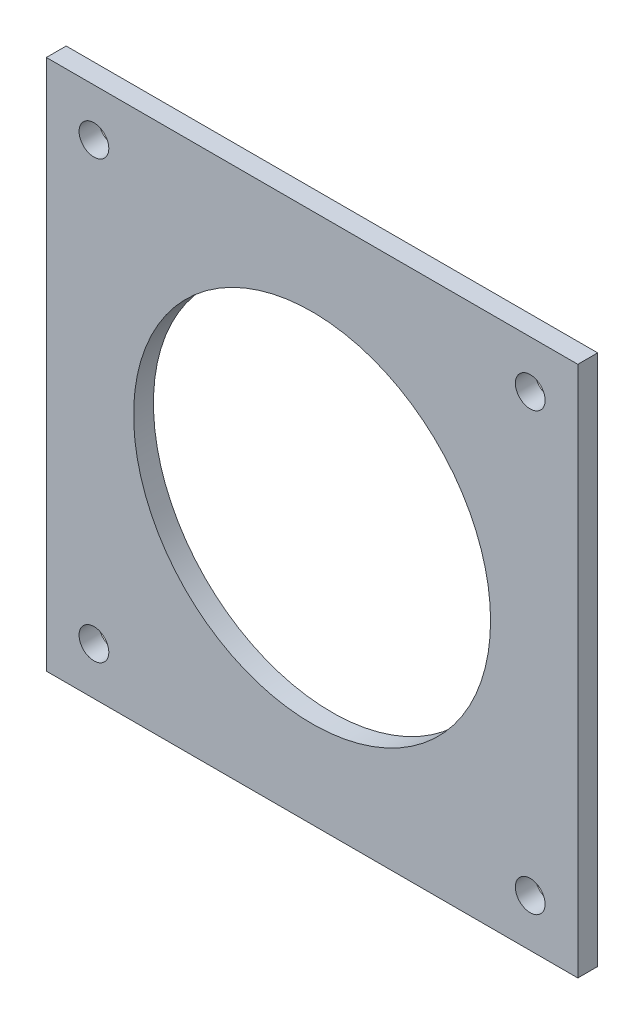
ISO-10303-21;
HEADER;
FILE_DESCRIPTION(('STEP AP214'),'2;1');
FILE_NAME('part.step','',(''),(''),'','','');
FILE_SCHEMA(('AUTOMOTIVE_DESIGN { 1 0 10303 214 1 1 1 1 }'));
ENDSEC;
DATA;
#1=APPLICATION_CONTEXT('core data for automotive mechanical design processes');
#2=APPLICATION_PROTOCOL_DEFINITION('international standard','automotive_design',2000,#1);
#3=PRODUCT_CONTEXT('',#1,'mechanical');
#4=PRODUCT('Part','Part','',(#3));
#5=PRODUCT_RELATED_PRODUCT_CATEGORY('part','',(#4));
#6=PRODUCT_DEFINITION_FORMATION('','',#4);
#7=PRODUCT_DEFINITION_CONTEXT('part definition',#1,'design');
#8=PRODUCT_DEFINITION('design','',#6,#7);
#9=PRODUCT_DEFINITION_SHAPE('','',#8);
#10=(LENGTH_UNIT() NAMED_UNIT(*) SI_UNIT(.MILLI.,.METRE.));
#11=(NAMED_UNIT(*) PLANE_ANGLE_UNIT() SI_UNIT($,.RADIAN.));
#12=(NAMED_UNIT(*) SI_UNIT($,.STERADIAN.) SOLID_ANGLE_UNIT());
#13=UNCERTAINTY_MEASURE_WITH_UNIT(LENGTH_MEASURE(1.E-05),#10,'distance_accuracy_value','');
#14=(GEOMETRIC_REPRESENTATION_CONTEXT(3) GLOBAL_UNCERTAINTY_ASSIGNED_CONTEXT((#13)) GLOBAL_UNIT_ASSIGNED_CONTEXT((#10,
#11,#12)) REPRESENTATION_CONTEXT('',''));
#15=CARTESIAN_POINT('',(0.,0.,0.));
#16=DIRECTION('',(0.,0.,1.));
#17=DIRECTION('',(1.,0.,0.));
#18=AXIS2_PLACEMENT_3D('',#15,#16,#17);
#19=CARTESIAN_POINT('',(-26.8,26.8,2.));
#20=DIRECTION('',(1.,0.,0.));
#21=DIRECTION('',(0.,1.,0.));
#22=AXIS2_PLACEMENT_3D('',#19,#20,#21);
#23=PLANE('',#22);
#24=DIRECTION('',(0.,-1.,0.));
#25=VECTOR('',#24,1.);
#26=CARTESIAN_POINT('',(-26.8,26.8,0.));
#27=LINE('',#26,#25);
#28=CARTESIAN_POINT('',(-26.8,26.8,0.));
#29=VERTEX_POINT('',#28);
#30=CARTESIAN_POINT('',(-26.8,-26.8,0.));
#31=VERTEX_POINT('',#30);
#32=EDGE_CURVE('E78',#29,#31,#27,.T.);
#33=ORIENTED_EDGE('',*,*,#32,.T.);
#34=DIRECTION('',(0.,0.,-1.));
#35=VECTOR('',#34,1.);
#36=CARTESIAN_POINT('',(-26.8,-26.8,2.));
#37=LINE('',#36,#35);
#38=CARTESIAN_POINT('',(-26.8,-26.8,2.));
#39=VERTEX_POINT('',#38);
#40=EDGE_CURVE('E10',#39,#31,#37,.T.);
#41=ORIENTED_EDGE('',*,*,#40,.F.);
#42=DIRECTION('',(0.,-1.,0.));
#43=VECTOR('',#42,1.);
#44=CARTESIAN_POINT('',(-26.8,26.8,2.));
#45=LINE('',#44,#43);
#46=CARTESIAN_POINT('',(-26.8,26.8,2.));
#47=VERTEX_POINT('',#46);
#48=EDGE_CURVE('E66',#47,#39,#45,.T.);
#49=ORIENTED_EDGE('',*,*,#48,.F.);
#50=DIRECTION('',(0.,0.,-1.));
#51=VECTOR('',#50,1.);
#52=CARTESIAN_POINT('',(-26.8,26.8,2.));
#53=LINE('',#52,#51);
#54=EDGE_CURVE('E74',#47,#29,#53,.T.);
#55=ORIENTED_EDGE('',*,*,#54,.T.);
#56=EDGE_LOOP('',(#33,#41,#49,#55));
#57=FACE_BOUND('',#56,.T.);
#58=ADVANCED_FACE('F15',(#57),#23,.F.);
#59=CARTESIAN_POINT('',(-26.8,-26.8,2.));
#60=DIRECTION('',(0.,1.,0.));
#61=DIRECTION('',(0.,0.,1.));
#62=AXIS2_PLACEMENT_3D('',#59,#60,#61);
#63=PLANE('',#62);
#64=DIRECTION('',(1.,0.,0.));
#65=VECTOR('',#64,1.);
#66=CARTESIAN_POINT('',(-26.8,-26.8,0.));
#67=LINE('',#66,#65);
#68=CARTESIAN_POINT('',(26.8,-26.8,0.));
#69=VERTEX_POINT('',#68);
#70=EDGE_CURVE('E70',#31,#69,#67,.T.);
#71=ORIENTED_EDGE('',*,*,#70,.T.);
#72=DIRECTION('',(0.,0.,-1.));
#73=VECTOR('',#72,1.);
#74=CARTESIAN_POINT('',(26.8,-26.8,2.));
#75=LINE('',#74,#73);
#76=CARTESIAN_POINT('',(26.8,-26.8,2.));
#77=VERTEX_POINT('',#76);
#78=EDGE_CURVE('E23',#77,#69,#75,.T.);
#79=ORIENTED_EDGE('',*,*,#78,.F.);
#80=DIRECTION('',(1.,0.,0.));
#81=VECTOR('',#80,1.);
#82=CARTESIAN_POINT('',(-26.8,-26.8,2.));
#83=LINE('',#82,#81);
#84=EDGE_CURVE('E61',#39,#77,#83,.T.);
#85=ORIENTED_EDGE('',*,*,#84,.F.);
#86=ORIENTED_EDGE('',*,*,#40,.T.);
#87=EDGE_LOOP('',(#71,#79,#85,#86));
#88=FACE_BOUND('',#87,.T.);
#89=ADVANCED_FACE('F69',(#88),#63,.F.);
#90=CARTESIAN_POINT('',(26.8,26.8,2.));
#91=DIRECTION('',(-1.,0.,0.));
#92=DIRECTION('',(0.,-1.,0.));
#93=AXIS2_PLACEMENT_3D('',#90,#91,#92);
#94=PLANE('',#93);
#95=DIRECTION('',(0.,1.,0.));
#96=VECTOR('',#95,1.);
#97=CARTESIAN_POINT('',(26.8,26.8,0.));
#98=LINE('',#97,#96);
#99=CARTESIAN_POINT('',(26.8,26.8,0.));
#100=VERTEX_POINT('',#99);
#101=EDGE_CURVE('E48',#69,#100,#98,.T.);
#102=ORIENTED_EDGE('',*,*,#101,.T.);
#103=DIRECTION('',(0.,0.,-1.));
#104=VECTOR('',#103,1.);
#105=CARTESIAN_POINT('',(26.8,26.8,2.));
#106=LINE('',#105,#104);
#107=CARTESIAN_POINT('',(26.8,26.8,2.));
#108=VERTEX_POINT('',#107);
#109=EDGE_CURVE('E71',#108,#100,#106,.T.);
#110=ORIENTED_EDGE('',*,*,#109,.F.);
#111=DIRECTION('',(0.,1.,0.));
#112=VECTOR('',#111,1.);
#113=CARTESIAN_POINT('',(26.8,26.8,2.));
#114=LINE('',#113,#112);
#115=EDGE_CURVE('E64',#77,#108,#114,.T.);
#116=ORIENTED_EDGE('',*,*,#115,.F.);
#117=ORIENTED_EDGE('',*,*,#78,.T.);
#118=EDGE_LOOP('',(#102,#110,#116,#117));
#119=FACE_BOUND('',#118,.T.);
#120=ADVANCED_FACE('F72',(#119),#94,.F.);
#121=CARTESIAN_POINT('',(-26.8,26.8,2.));
#122=DIRECTION('',(0.,-1.,0.));
#123=DIRECTION('',(0.,0.,-1.));
#124=AXIS2_PLACEMENT_3D('',#121,#122,#123);
#125=PLANE('',#124);
#126=DIRECTION('',(-1.,0.,0.));
#127=VECTOR('',#126,1.);
#128=CARTESIAN_POINT('',(-26.8,26.8,0.));
#129=LINE('',#128,#127);
#130=EDGE_CURVE('E54',#100,#29,#129,.T.);
#131=ORIENTED_EDGE('',*,*,#130,.T.);
#132=ORIENTED_EDGE('',*,*,#54,.F.);
#133=DIRECTION('',(-1.,0.,0.));
#134=VECTOR('',#133,1.);
#135=CARTESIAN_POINT('',(-26.8,26.8,2.));
#136=LINE('',#135,#134);
#137=EDGE_CURVE('E31',#108,#47,#136,.T.);
#138=ORIENTED_EDGE('',*,*,#137,.F.);
#139=ORIENTED_EDGE('',*,*,#109,.T.);
#140=EDGE_LOOP('',(#131,#132,#138,#139));
#141=FACE_BOUND('',#140,.T.);
#142=ADVANCED_FACE('F86',(#141),#125,.F.);
#143=CARTESIAN_POINT('',(-26.8,-26.8,2.));
#144=DIRECTION('',(0.,0.,1.));
#145=DIRECTION('',(1.,0.,0.));
#146=AXIS2_PLACEMENT_3D('',#143,#144,#145);
#147=PLANE('',#146);
#148=CARTESIAN_POINT('',(0.,0.,2.));
#149=DIRECTION('',(0.,0.,1.));
#150=DIRECTION('',(1.,0.,0.));
#151=AXIS2_PLACEMENT_3D('',#148,#149,#150);
#152=CIRCLE('',#151,18.);
#153=CARTESIAN_POINT('',(18.,0.,2.));
#154=VERTEX_POINT('',#153);
#155=EDGE_CURVE('E118',#154,#154,#152,.T.);
#156=ORIENTED_EDGE('',*,*,#155,.F.);
#157=EDGE_LOOP('',(#156));
#158=FACE_BOUND('',#157,.T.);
#159=CARTESIAN_POINT('',(-22.,-22.,2.));
#160=DIRECTION('',(0.,0.,1.));
#161=DIRECTION('',(-1.,0.,0.));
#162=AXIS2_PLACEMENT_3D('',#159,#160,#161);
#163=CIRCLE('',#162,1.5);
#164=CARTESIAN_POINT('',(-23.5,-22.,2.));
#165=VERTEX_POINT('',#164);
#166=EDGE_CURVE('E110',#165,#165,#163,.T.);
#167=ORIENTED_EDGE('',*,*,#166,.F.);
#168=EDGE_LOOP('',(#167));
#169=FACE_BOUND('',#168,.T.);
#170=CARTESIAN_POINT('',(22.,-22.,2.));
#171=DIRECTION('',(0.,0.,1.));
#172=DIRECTION('',(1.,0.,0.));
#173=AXIS2_PLACEMENT_3D('',#170,#171,#172);
#174=CIRCLE('',#173,1.5);
#175=CARTESIAN_POINT('',(23.5,-22.,2.));
#176=VERTEX_POINT('',#175);
#177=EDGE_CURVE('E104',#176,#176,#174,.T.);
#178=ORIENTED_EDGE('',*,*,#177,.F.);
#179=EDGE_LOOP('',(#178));
#180=FACE_BOUND('',#179,.T.);
#181=CARTESIAN_POINT('',(22.,22.,2.));
#182=DIRECTION('',(0.,0.,1.));
#183=DIRECTION('',(-1.,0.,0.));
#184=AXIS2_PLACEMENT_3D('',#181,#182,#183);
#185=CIRCLE('',#184,1.5);
#186=CARTESIAN_POINT('',(20.5,22.,2.));
#187=VERTEX_POINT('',#186);
#188=EDGE_CURVE('E98',#187,#187,#185,.T.);
#189=ORIENTED_EDGE('',*,*,#188,.F.);
#190=EDGE_LOOP('',(#189));
#191=FACE_BOUND('',#190,.T.);
#192=CARTESIAN_POINT('',(-22.,22.,2.));
#193=DIRECTION('',(0.,0.,1.));
#194=DIRECTION('',(1.,0.,0.));
#195=AXIS2_PLACEMENT_3D('',#192,#193,#194);
#196=CIRCLE('',#195,1.5);
#197=CARTESIAN_POINT('',(-20.5,22.,2.));
#198=VERTEX_POINT('',#197);
#199=EDGE_CURVE('E92',#198,#198,#196,.T.);
#200=ORIENTED_EDGE('',*,*,#199,.F.);
#201=EDGE_LOOP('',(#200));
#202=FACE_BOUND('',#201,.T.);
#203=ORIENTED_EDGE('',*,*,#48,.T.);
#204=ORIENTED_EDGE('',*,*,#84,.T.);
#205=ORIENTED_EDGE('',*,*,#115,.T.);
#206=ORIENTED_EDGE('',*,*,#137,.T.);
#207=EDGE_LOOP('',(#203,#204,#205,#206));
#208=FACE_BOUND('',#207,.T.);
#209=ADVANCED_FACE('F62',(#158,#169,#180,#191,#202,#208),#147,.T.);
#210=CARTESIAN_POINT('',(-26.8,-26.8,0.));
#211=DIRECTION('',(0.,0.,1.));
#212=DIRECTION('',(1.,0.,0.));
#213=AXIS2_PLACEMENT_3D('',#210,#211,#212);
#214=PLANE('',#213);
#215=CARTESIAN_POINT('',(0.,0.,0.));
#216=DIRECTION('',(0.,0.,1.));
#217=DIRECTION('',(1.,0.,0.));
#218=AXIS2_PLACEMENT_3D('',#215,#216,#217);
#219=CIRCLE('',#218,18.);
#220=CARTESIAN_POINT('',(18.,0.,0.));
#221=VERTEX_POINT('',#220);
#222=EDGE_CURVE('E113',#221,#221,#219,.F.);
#223=ORIENTED_EDGE('',*,*,#222,.F.);
#224=EDGE_LOOP('',(#223));
#225=FACE_BOUND('',#224,.T.);
#226=CARTESIAN_POINT('',(-22.,-22.,0.));
#227=DIRECTION('',(0.,0.,1.));
#228=DIRECTION('',(-1.,0.,0.));
#229=AXIS2_PLACEMENT_3D('',#226,#227,#228);
#230=CIRCLE('',#229,1.5);
#231=CARTESIAN_POINT('',(-23.5,-22.,0.));
#232=VERTEX_POINT('',#231);
#233=EDGE_CURVE('E107',#232,#232,#230,.T.);
#234=ORIENTED_EDGE('',*,*,#233,.T.);
#235=EDGE_LOOP('',(#234));
#236=FACE_BOUND('',#235,.T.);
#237=CARTESIAN_POINT('',(22.,-22.,0.));
#238=DIRECTION('',(0.,0.,1.));
#239=DIRECTION('',(1.,0.,0.));
#240=AXIS2_PLACEMENT_3D('',#237,#238,#239);
#241=CIRCLE('',#240,1.5);
#242=CARTESIAN_POINT('',(23.5,-22.,0.));
#243=VERTEX_POINT('',#242);
#244=EDGE_CURVE('E101',#243,#243,#241,.T.);
#245=ORIENTED_EDGE('',*,*,#244,.T.);
#246=EDGE_LOOP('',(#245));
#247=FACE_BOUND('',#246,.T.);
#248=CARTESIAN_POINT('',(22.,22.,0.));
#249=DIRECTION('',(0.,0.,1.));
#250=DIRECTION('',(-1.,0.,0.));
#251=AXIS2_PLACEMENT_3D('',#248,#249,#250);
#252=CIRCLE('',#251,1.5);
#253=CARTESIAN_POINT('',(20.5,22.,0.));
#254=VERTEX_POINT('',#253);
#255=EDGE_CURVE('E95',#254,#254,#252,.T.);
#256=ORIENTED_EDGE('',*,*,#255,.T.);
#257=EDGE_LOOP('',(#256));
#258=FACE_BOUND('',#257,.T.);
#259=CARTESIAN_POINT('',(-22.,22.,0.));
#260=DIRECTION('',(0.,0.,1.));
#261=DIRECTION('',(1.,0.,0.));
#262=AXIS2_PLACEMENT_3D('',#259,#260,#261);
#263=CIRCLE('',#262,1.5);
#264=CARTESIAN_POINT('',(-20.5,22.,0.));
#265=VERTEX_POINT('',#264);
#266=EDGE_CURVE('E81',#265,#265,#263,.T.);
#267=ORIENTED_EDGE('',*,*,#266,.T.);
#268=EDGE_LOOP('',(#267));
#269=FACE_BOUND('',#268,.T.);
#270=ORIENTED_EDGE('',*,*,#32,.F.);
#271=ORIENTED_EDGE('',*,*,#130,.F.);
#272=ORIENTED_EDGE('',*,*,#101,.F.);
#273=ORIENTED_EDGE('',*,*,#70,.F.);
#274=EDGE_LOOP('',(#270,#271,#272,#273));
#275=FACE_BOUND('',#274,.T.);
#276=ADVANCED_FACE('F89',(#225,#236,#247,#258,#269,#275),#214,.F.);
#277=CARTESIAN_POINT('',(-22.,22.,0.));
#278=DIRECTION('',(0.,0.,1.));
#279=DIRECTION('',(1.,0.,0.));
#280=AXIS2_PLACEMENT_3D('',#277,#278,#279);
#281=CYLINDRICAL_SURFACE('',#280,1.5);
#282=ORIENTED_EDGE('',*,*,#266,.F.);
#283=EDGE_LOOP('',(#282));
#284=FACE_BOUND('',#283,.T.);
#285=ORIENTED_EDGE('',*,*,#199,.T.);
#286=EDGE_LOOP('',(#285));
#287=FACE_BOUND('',#286,.T.);
#288=ADVANCED_FACE('F136',(#284,#287),#281,.F.);
#289=CARTESIAN_POINT('',(22.,22.,0.));
#290=DIRECTION('',(0.,0.,1.));
#291=DIRECTION('',(1.,0.,0.));
#292=AXIS2_PLACEMENT_3D('',#289,#290,#291);
#293=CYLINDRICAL_SURFACE('',#292,1.5);
#294=ORIENTED_EDGE('',*,*,#255,.F.);
#295=EDGE_LOOP('',(#294));
#296=FACE_BOUND('',#295,.T.);
#297=ORIENTED_EDGE('',*,*,#188,.T.);
#298=EDGE_LOOP('',(#297));
#299=FACE_BOUND('',#298,.T.);
#300=ADVANCED_FACE('F138',(#296,#299),#293,.F.);
#301=CARTESIAN_POINT('',(22.,-22.,0.));
#302=DIRECTION('',(0.,0.,1.));
#303=DIRECTION('',(1.,0.,0.));
#304=AXIS2_PLACEMENT_3D('',#301,#302,#303);
#305=CYLINDRICAL_SURFACE('',#304,1.5);
#306=ORIENTED_EDGE('',*,*,#244,.F.);
#307=EDGE_LOOP('',(#306));
#308=FACE_BOUND('',#307,.T.);
#309=ORIENTED_EDGE('',*,*,#177,.T.);
#310=EDGE_LOOP('',(#309));
#311=FACE_BOUND('',#310,.T.);
#312=ADVANCED_FACE('F147',(#308,#311),#305,.F.);
#313=CARTESIAN_POINT('',(-22.,-22.,0.));
#314=DIRECTION('',(0.,0.,1.));
#315=DIRECTION('',(1.,0.,0.));
#316=AXIS2_PLACEMENT_3D('',#313,#314,#315);
#317=CYLINDRICAL_SURFACE('',#316,1.5);
#318=ORIENTED_EDGE('',*,*,#233,.F.);
#319=EDGE_LOOP('',(#318));
#320=FACE_BOUND('',#319,.T.);
#321=ORIENTED_EDGE('',*,*,#166,.T.);
#322=EDGE_LOOP('',(#321));
#323=FACE_BOUND('',#322,.T.);
#324=ADVANCED_FACE('F213',(#320,#323),#317,.F.);
#325=CARTESIAN_POINT('',(0.,0.,-0.00100000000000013));
#326=DIRECTION('',(0.,0.,1.));
#327=DIRECTION('',(1.,0.,0.));
#328=AXIS2_PLACEMENT_3D('',#325,#326,#327);
#329=CYLINDRICAL_SURFACE('',#328,18.);
#330=ORIENTED_EDGE('',*,*,#155,.T.);
#331=EDGE_LOOP('',(#330));
#332=FACE_BOUND('',#331,.T.);
#333=ORIENTED_EDGE('',*,*,#222,.T.);
#334=EDGE_LOOP('',(#333));
#335=FACE_BOUND('',#334,.T.);
#336=ADVANCED_FACE('F122',(#332,#335),#329,.F.);
#337=CLOSED_SHELL('',(#58,#89,#120,#142,#209,#276,#288,#300,#312,#324,#336));
#338=MANIFOLD_SOLID_BREP('B1',#337);
#339=ADVANCED_BREP_SHAPE_REPRESENTATION('',(#18,#338),#14);
#340=SHAPE_DEFINITION_REPRESENTATION(#9,#339);
ENDSEC;
END-ISO-10303-21;
